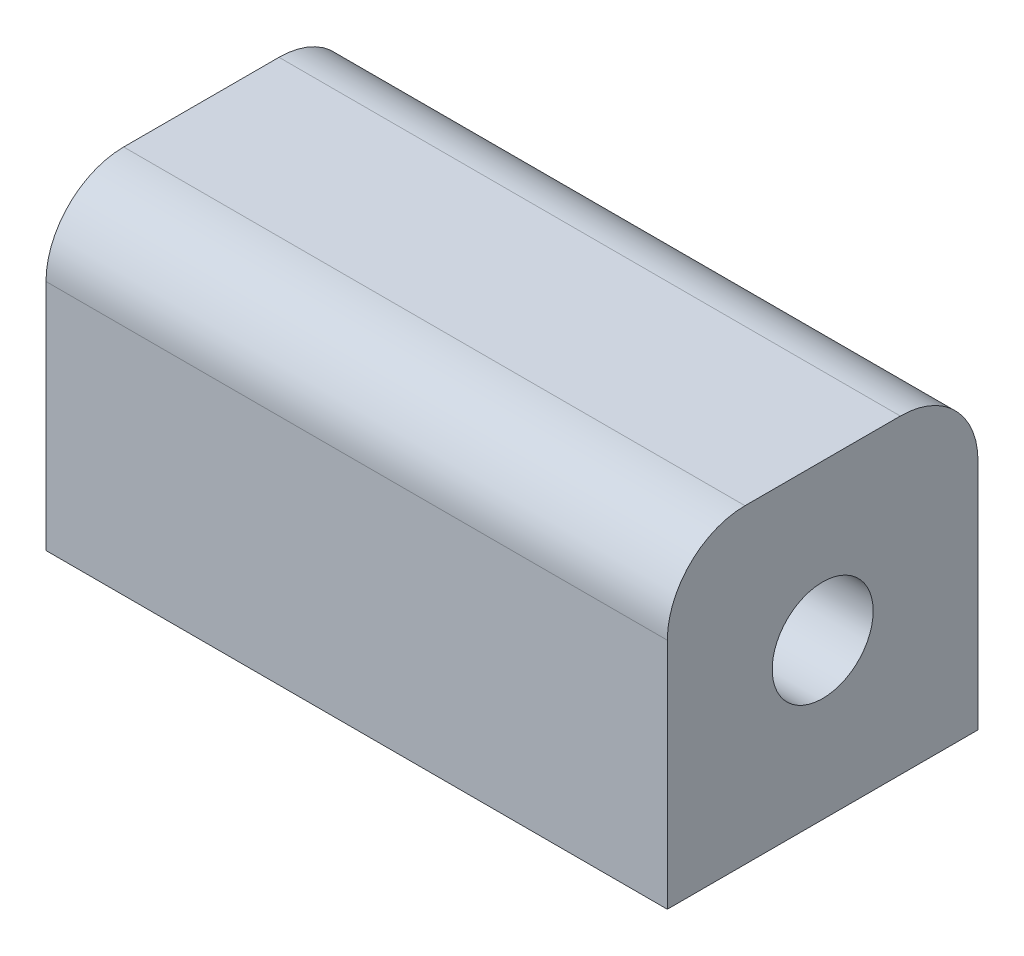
from build123d import *

# Parameters (mm, degrees)
SKETCH1_W      = 40
SKETCH1_H      = 20
EXTRUDE1_DEPTH = 20
SKETCH2_R      = 3.25
EXTRUDE2_DEPTH = 49.989794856
SKETCH3_R      = 1.5
EXTRUDE3_DEPTH = 10
FILLET1_R      = 5


with BuildPart() as part:
    # Sketch1 → Extrude1 (new body)
    with BuildSketch(Plane(origin=(0, 0, 0), x_dir=(1, 0, 0), z_dir=(0, 1, 0))):
        with Locations((20, 10)):
            Rectangle(SKETCH1_W, SKETCH1_H)
    extrude(amount=EXTRUDE1_DEPTH)

    # Sketch2 → Extrude2 (cut, through all)
    with BuildSketch(Plane(origin=(40, 0, 0), x_dir=(0, 0, -1), z_dir=(1, 0, 0))):
        with Locations((10, 10)):
            Circle(SKETCH2_R)
    extrude(amount=-EXTRUDE2_DEPTH, mode=Mode.SUBTRACT)

    # Sketch3 → Extrude3 (cut)
    with BuildSketch(Plane.XZ):
        with Locations(Location((30, -10, 0), (0, 0, 270))):
            Circle(SKETCH3_R)
        with Locations(Location((10, -10, 0), (0, 0, 270))):
            Circle(SKETCH3_R)
    extrude(amount=-EXTRUDE3_DEPTH, mode=Mode.SUBTRACT)

    # Fillet1
    fillet1_edges = [part.edges().sort_by_distance(p)[0] for p in [
        (20, 20, -20),
        (20, 20, 0),
    ]]
    fillet(fillet1_edges, radius=FILLET1_R)


solid = part.part
